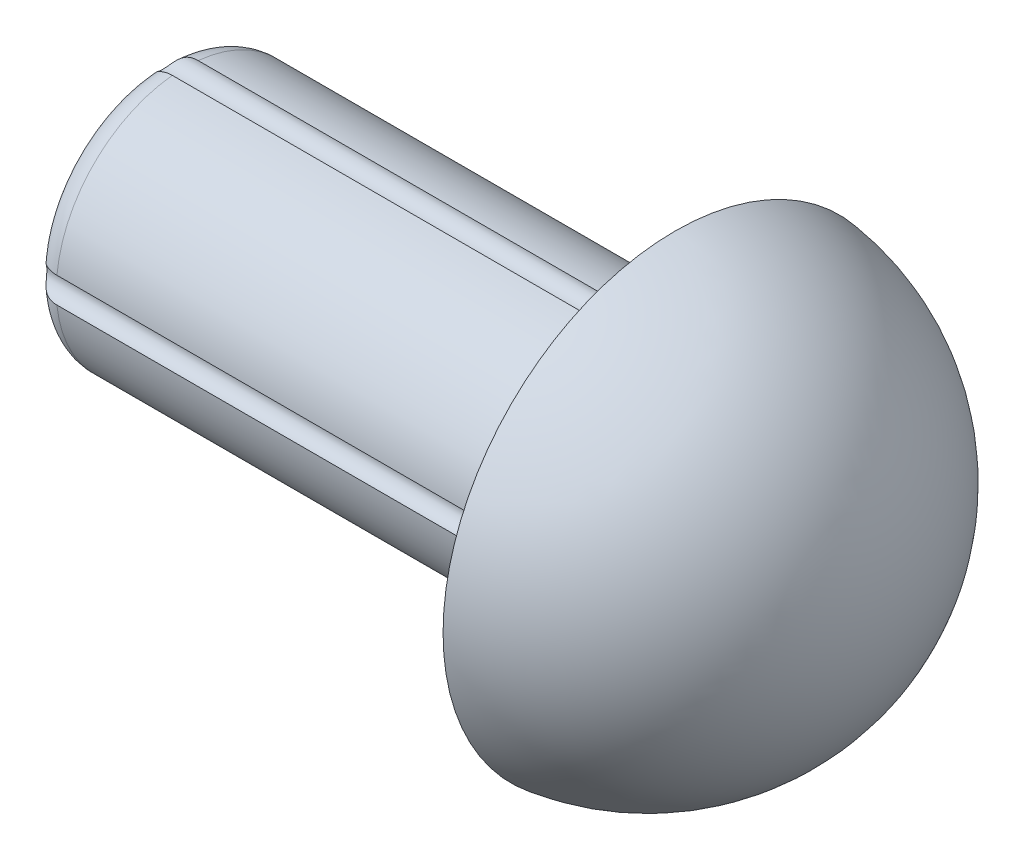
from build123d import *

# Parameters (mm, degrees)
ESQUISSE2_W                  = 10
ESQUISSE2_H                  = 0.25
R_P_TITION_CIRCULAIRE1_COUNT = 4


with BuildPart() as part:
    # Esquisse1 → Base-R_volution (revolve)
    with BuildSketch(Plane.XY, mode=Mode.PRIVATE) as base_r_volution_sk:
        with BuildLine():
            Line((10, 2.5), (10, 4.5))
            ThreePointArc((10, 4.5), (12.855448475, 3.010398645), (14, 0))
            Line((14, 0), (0, 0))
            Line((0, 0), (0, 2))
            ThreePointArc((0, 2), (0.146446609, 2.353553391), (0.5, 2.5))
            Line((0.5, 2.5), (10, 2.5))
        make_face()
    revolve(base_r_volution_sk.sketch.rotate(Axis((0, 0, 0), (1, 0, 0)), 90), axis=Axis((0, 0, 0), (1, 0, 0)))

    # Esquisse2 → Enlever de la mati_re-R_volution1 (revolve, cut)
    with BuildSketch(Plane(origin=(0, 2.5, 0), x_dir=(-1, 0, 0), z_dir=(0, 1, 0))):
        with Locations((-5, 0.125)):
            Rectangle(ESQUISSE2_W, ESQUISSE2_H)
    enlever_de_la_mati_re_r_volution1 = revolve(axis=Axis((0, 2.5, 0), (1, 0, 0)), mode=Mode.SUBTRACT)

    # R_p_tition circulaire1: Enlever de la mati_re-R_volution1 ×4 about axis
    r_p_tition_circulaire1_axis = Axis((50, 0, 0), (-1, 0, 0))
    for i in range(1, R_P_TITION_CIRCULAIRE1_COUNT):
        add(enlever_de_la_mati_re_r_volution1.rotate(r_p_tition_circulaire1_axis, i * 360 / R_P_TITION_CIRCULAIRE1_COUNT), mode=Mode.SUBTRACT)


solid = part.part
